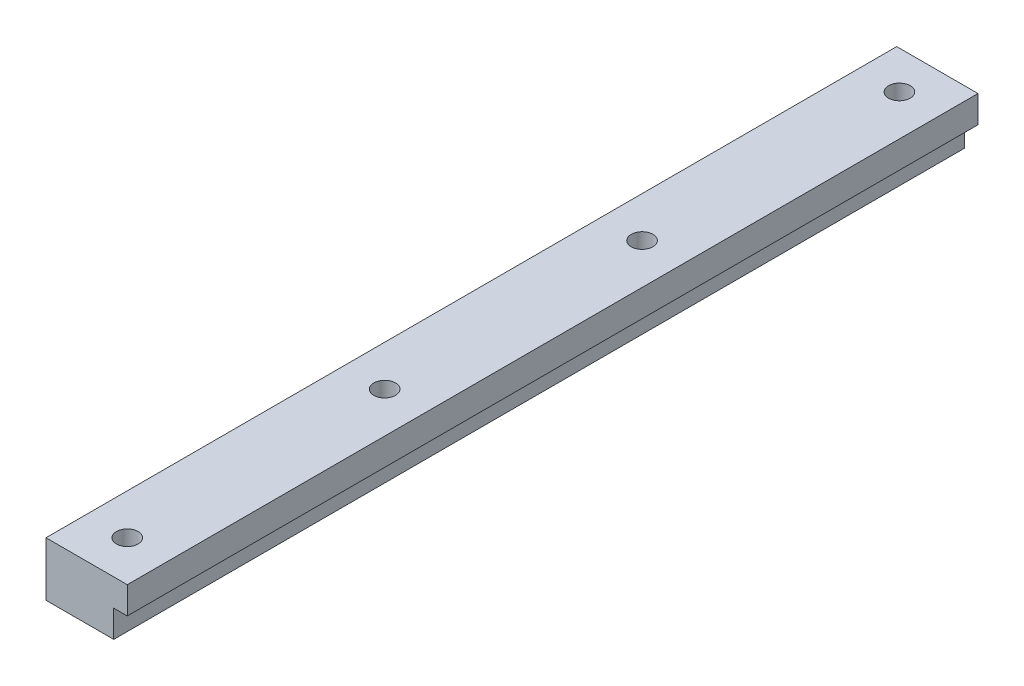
ISO-10303-21;
HEADER;
FILE_DESCRIPTION(('STEP AP214'),'2;1');
FILE_NAME('part.step','',(''),(''),'','','');
FILE_SCHEMA(('AUTOMOTIVE_DESIGN { 1 0 10303 214 1 1 1 1 }'));
ENDSEC;
DATA;
#1=APPLICATION_CONTEXT('core data for automotive mechanical design processes');
#2=APPLICATION_PROTOCOL_DEFINITION('international standard','automotive_design',2000,#1);
#3=PRODUCT_CONTEXT('',#1,'mechanical');
#4=PRODUCT('Part','Part','',(#3));
#5=PRODUCT_RELATED_PRODUCT_CATEGORY('part','',(#4));
#6=PRODUCT_DEFINITION_FORMATION('','',#4);
#7=PRODUCT_DEFINITION_CONTEXT('part definition',#1,'design');
#8=PRODUCT_DEFINITION('design','',#6,#7);
#9=PRODUCT_DEFINITION_SHAPE('','',#8);
#10=(LENGTH_UNIT() NAMED_UNIT(*) SI_UNIT(.MILLI.,.METRE.));
#11=(NAMED_UNIT(*) PLANE_ANGLE_UNIT() SI_UNIT($,.RADIAN.));
#12=(NAMED_UNIT(*) SI_UNIT($,.STERADIAN.) SOLID_ANGLE_UNIT());
#13=UNCERTAINTY_MEASURE_WITH_UNIT(LENGTH_MEASURE(1.E-05),#10,'distance_accuracy_value','');
#14=(GEOMETRIC_REPRESENTATION_CONTEXT(3) GLOBAL_UNCERTAINTY_ASSIGNED_CONTEXT((#13)) GLOBAL_UNIT_ASSIGNED_CONTEXT((#10,
#11,#12)) REPRESENTATION_CONTEXT('',''));
#15=CARTESIAN_POINT('',(0.,0.,0.));
#16=DIRECTION('',(0.,0.,1.));
#17=DIRECTION('',(1.,0.,0.));
#18=AXIS2_PLACEMENT_3D('',#15,#16,#17);
#19=CARTESIAN_POINT('',(25.,0.,314.));
#20=DIRECTION('',(0.,1.,0.));
#21=DIRECTION('',(-1.,0.,0.));
#22=AXIS2_PLACEMENT_3D('',#19,#20,#21);
#23=PLANE('',#22);
#24=CARTESIAN_POINT('',(15.,0.,109.));
#25=DIRECTION('',(0.,1.,0.));
#26=DIRECTION('',(-1.,0.,0.));
#27=AXIS2_PLACEMENT_3D('',#24,#25,#26);
#28=CIRCLE('',#27,4.);
#29=CARTESIAN_POINT('',(11.,0.,109.));
#30=VERTEX_POINT('',#29);
#31=EDGE_CURVE('E151',#30,#30,#28,.T.);
#32=ORIENTED_EDGE('',*,*,#31,.T.);
#33=EDGE_LOOP('',(#32));
#34=FACE_BOUND('',#33,.T.);
#35=CARTESIAN_POINT('',(15.,0.,14.));
#36=DIRECTION('',(0.,1.,0.));
#37=DIRECTION('',(-1.,0.,0.));
#38=AXIS2_PLACEMENT_3D('',#35,#36,#37);
#39=CIRCLE('',#38,4.);
#40=CARTESIAN_POINT('',(11.,0.,14.));
#41=VERTEX_POINT('',#40);
#42=EDGE_CURVE('E155',#41,#41,#39,.T.);
#43=ORIENTED_EDGE('',*,*,#42,.T.);
#44=EDGE_LOOP('',(#43));
#45=FACE_BOUND('',#44,.T.);
#46=CARTESIAN_POINT('',(15.,0.,204.));
#47=DIRECTION('',(0.,1.,0.));
#48=DIRECTION('',(-1.,0.,0.));
#49=AXIS2_PLACEMENT_3D('',#46,#47,#48);
#50=CIRCLE('',#49,4.);
#51=CARTESIAN_POINT('',(11.,0.,204.));
#52=VERTEX_POINT('',#51);
#53=EDGE_CURVE('E159',#52,#52,#50,.T.);
#54=ORIENTED_EDGE('',*,*,#53,.T.);
#55=EDGE_LOOP('',(#54));
#56=FACE_BOUND('',#55,.T.);
#57=CARTESIAN_POINT('',(15.,0.,299.));
#58=DIRECTION('',(0.,1.,0.));
#59=DIRECTION('',(-1.,0.,0.));
#60=AXIS2_PLACEMENT_3D('',#57,#58,#59);
#61=CIRCLE('',#60,4.);
#62=CARTESIAN_POINT('',(11.,0.,299.));
#63=VERTEX_POINT('',#62);
#64=EDGE_CURVE('E87',#63,#63,#61,.T.);
#65=ORIENTED_EDGE('',*,*,#64,.T.);
#66=EDGE_LOOP('',(#65));
#67=FACE_BOUND('',#66,.T.);
#68=DIRECTION('',(1.,0.,0.));
#69=VECTOR('',#68,1.);
#70=CARTESIAN_POINT('',(25.,0.,0.));
#71=LINE('',#70,#69);
#72=CARTESIAN_POINT('',(0.,0.,0.));
#73=VERTEX_POINT('',#72);
#74=CARTESIAN_POINT('',(25.,0.,0.));
#75=VERTEX_POINT('',#74);
#76=EDGE_CURVE('E73',#73,#75,#71,.T.);
#77=ORIENTED_EDGE('',*,*,#76,.T.);
#78=DIRECTION('',(0.,0.,-1.));
#79=VECTOR('',#78,1.);
#80=CARTESIAN_POINT('',(25.,0.,314.));
#81=LINE('',#80,#79);
#82=CARTESIAN_POINT('',(25.,0.,314.));
#83=VERTEX_POINT('',#82);
#84=EDGE_CURVE('E11',#83,#75,#81,.T.);
#85=ORIENTED_EDGE('',*,*,#84,.F.);
#86=DIRECTION('',(1.,0.,0.));
#87=VECTOR('',#86,1.);
#88=CARTESIAN_POINT('',(25.,0.,314.));
#89=LINE('',#88,#87);
#90=CARTESIAN_POINT('',(0.,0.,314.));
#91=VERTEX_POINT('',#90);
#92=EDGE_CURVE('E101',#91,#83,#89,.T.);
#93=ORIENTED_EDGE('',*,*,#92,.F.);
#94=DIRECTION('',(0.,0.,-1.));
#95=VECTOR('',#94,1.);
#96=CARTESIAN_POINT('',(0.,0.,314.));
#97=LINE('',#96,#95);
#98=EDGE_CURVE('E86',#91,#73,#97,.T.);
#99=ORIENTED_EDGE('',*,*,#98,.T.);
#100=EDGE_LOOP('',(#77,#85,#93,#99));
#101=FACE_BOUND('',#100,.T.);
#102=ADVANCED_FACE('F17',(#34,#45,#56,#67,#101),#23,.F.);
#103=CARTESIAN_POINT('',(25.,10.,314.));
#104=DIRECTION('',(-1.,0.,0.));
#105=DIRECTION('',(0.,0.,1.));
#106=AXIS2_PLACEMENT_3D('',#103,#104,#105);
#107=PLANE('',#106);
#108=DIRECTION('',(0.,1.,0.));
#109=VECTOR('',#108,1.);
#110=CARTESIAN_POINT('',(25.,10.,0.));
#111=LINE('',#110,#109);
#112=CARTESIAN_POINT('',(25.,10.,0.));
#113=VERTEX_POINT('',#112);
#114=EDGE_CURVE('E69',#75,#113,#111,.T.);
#115=ORIENTED_EDGE('',*,*,#114,.T.);
#116=DIRECTION('',(0.,0.,-1.));
#117=VECTOR('',#116,1.);
#118=CARTESIAN_POINT('',(25.,10.,314.));
#119=LINE('',#118,#117);
#120=CARTESIAN_POINT('',(25.,10.,314.));
#121=VERTEX_POINT('',#120);
#122=EDGE_CURVE('E24',#121,#113,#119,.T.);
#123=ORIENTED_EDGE('',*,*,#122,.F.);
#124=DIRECTION('',(0.,1.,0.));
#125=VECTOR('',#124,1.);
#126=CARTESIAN_POINT('',(25.,10.,314.));
#127=LINE('',#126,#125);
#128=EDGE_CURVE('E82',#83,#121,#127,.T.);
#129=ORIENTED_EDGE('',*,*,#128,.F.);
#130=ORIENTED_EDGE('',*,*,#84,.T.);
#131=EDGE_LOOP('',(#115,#123,#129,#130));
#132=FACE_BOUND('',#131,.T.);
#133=ADVANCED_FACE('F81',(#132),#107,.F.);
#134=CARTESIAN_POINT('',(30.,10.,314.));
#135=DIRECTION('',(0.,1.,0.));
#136=DIRECTION('',(0.,0.,1.));
#137=AXIS2_PLACEMENT_3D('',#134,#135,#136);
#138=PLANE('',#137);
#139=DIRECTION('',(1.,0.,0.));
#140=VECTOR('',#139,1.);
#141=CARTESIAN_POINT('',(30.,10.,0.));
#142=LINE('',#141,#140);
#143=CARTESIAN_POINT('',(30.,10.,0.));
#144=VERTEX_POINT('',#143);
#145=EDGE_CURVE('E75',#113,#144,#142,.T.);
#146=ORIENTED_EDGE('',*,*,#145,.T.);
#147=DIRECTION('',(0.,0.,-1.));
#148=VECTOR('',#147,1.);
#149=CARTESIAN_POINT('',(30.,10.,314.));
#150=LINE('',#149,#148);
#151=CARTESIAN_POINT('',(30.,10.,314.));
#152=VERTEX_POINT('',#151);
#153=EDGE_CURVE('E117',#152,#144,#150,.T.);
#154=ORIENTED_EDGE('',*,*,#153,.F.);
#155=DIRECTION('',(1.,0.,0.));
#156=VECTOR('',#155,1.);
#157=CARTESIAN_POINT('',(30.,10.,314.));
#158=LINE('',#157,#156);
#159=EDGE_CURVE('E104',#121,#152,#158,.T.);
#160=ORIENTED_EDGE('',*,*,#159,.F.);
#161=ORIENTED_EDGE('',*,*,#122,.T.);
#162=EDGE_LOOP('',(#146,#154,#160,#161));
#163=FACE_BOUND('',#162,.T.);
#164=ADVANCED_FACE('F121',(#163),#138,.F.);
#165=CARTESIAN_POINT('',(30.,20.,314.));
#166=DIRECTION('',(-1.,0.,0.));
#167=DIRECTION('',(0.,-1.,0.));
#168=AXIS2_PLACEMENT_3D('',#165,#166,#167);
#169=PLANE('',#168);
#170=DIRECTION('',(0.,1.,0.));
#171=VECTOR('',#170,1.);
#172=CARTESIAN_POINT('',(30.,20.,0.));
#173=LINE('',#172,#171);
#174=CARTESIAN_POINT('',(30.,20.,0.));
#175=VERTEX_POINT('',#174);
#176=EDGE_CURVE('E95',#144,#175,#173,.T.);
#177=ORIENTED_EDGE('',*,*,#176,.T.);
#178=DIRECTION('',(0.,0.,-1.));
#179=VECTOR('',#178,1.);
#180=CARTESIAN_POINT('',(30.,20.,314.));
#181=LINE('',#180,#179);
#182=CARTESIAN_POINT('',(30.,20.,314.));
#183=VERTEX_POINT('',#182);
#184=EDGE_CURVE('E114',#183,#175,#181,.T.);
#185=ORIENTED_EDGE('',*,*,#184,.F.);
#186=DIRECTION('',(0.,1.,0.));
#187=VECTOR('',#186,1.);
#188=CARTESIAN_POINT('',(30.,20.,314.));
#189=LINE('',#188,#187);
#190=EDGE_CURVE('E106',#152,#183,#189,.T.);
#191=ORIENTED_EDGE('',*,*,#190,.F.);
#192=ORIENTED_EDGE('',*,*,#153,.T.);
#193=EDGE_LOOP('',(#177,#185,#191,#192));
#194=FACE_BOUND('',#193,.T.);
#195=ADVANCED_FACE('F127',(#194),#169,.F.);
#196=CARTESIAN_POINT('',(0.,20.,314.));
#197=DIRECTION('',(0.,-1.,0.));
#198=DIRECTION('',(0.,0.,-1.));
#199=AXIS2_PLACEMENT_3D('',#196,#197,#198);
#200=PLANE('',#199);
#201=CARTESIAN_POINT('',(15.,20.,109.));
#202=DIRECTION('',(0.,1.,0.));
#203=DIRECTION('',(0.,0.,1.));
#204=AXIS2_PLACEMENT_3D('',#201,#202,#203);
#205=CIRCLE('',#204,4.);
#206=CARTESIAN_POINT('',(15.,20.,113.));
#207=VERTEX_POINT('',#206);
#208=EDGE_CURVE('E189',#207,#207,#205,.T.);
#209=ORIENTED_EDGE('',*,*,#208,.F.);
#210=EDGE_LOOP('',(#209));
#211=FACE_BOUND('',#210,.T.);
#212=CARTESIAN_POINT('',(15.,20.,14.));
#213=DIRECTION('',(0.,1.,0.));
#214=DIRECTION('',(0.,0.,1.));
#215=AXIS2_PLACEMENT_3D('',#212,#213,#214);
#216=CIRCLE('',#215,4.);
#217=CARTESIAN_POINT('',(15.,20.,18.));
#218=VERTEX_POINT('',#217);
#219=EDGE_CURVE('E190',#218,#218,#216,.T.);
#220=ORIENTED_EDGE('',*,*,#219,.F.);
#221=EDGE_LOOP('',(#220));
#222=FACE_BOUND('',#221,.T.);
#223=CARTESIAN_POINT('',(15.,20.,204.));
#224=DIRECTION('',(0.,1.,0.));
#225=DIRECTION('',(0.,0.,1.));
#226=AXIS2_PLACEMENT_3D('',#223,#224,#225);
#227=CIRCLE('',#226,4.);
#228=CARTESIAN_POINT('',(15.,20.,208.));
#229=VERTEX_POINT('',#228);
#230=EDGE_CURVE('E197',#229,#229,#227,.T.);
#231=ORIENTED_EDGE('',*,*,#230,.F.);
#232=EDGE_LOOP('',(#231));
#233=FACE_BOUND('',#232,.T.);
#234=CARTESIAN_POINT('',(15.,20.,299.));
#235=DIRECTION('',(0.,1.,0.));
#236=DIRECTION('',(0.,0.,1.));
#237=AXIS2_PLACEMENT_3D('',#234,#235,#236);
#238=CIRCLE('',#237,4.);
#239=CARTESIAN_POINT('',(15.,20.,303.));
#240=VERTEX_POINT('',#239);
#241=EDGE_CURVE('E90',#240,#240,#238,.T.);
#242=ORIENTED_EDGE('',*,*,#241,.F.);
#243=EDGE_LOOP('',(#242));
#244=FACE_BOUND('',#243,.T.);
#245=DIRECTION('',(-1.,0.,0.));
#246=VECTOR('',#245,1.);
#247=CARTESIAN_POINT('',(0.,20.,0.));
#248=LINE('',#247,#246);
#249=CARTESIAN_POINT('',(0.,20.,0.));
#250=VERTEX_POINT('',#249);
#251=EDGE_CURVE('E97',#175,#250,#248,.T.);
#252=ORIENTED_EDGE('',*,*,#251,.T.);
#253=DIRECTION('',(0.,0.,-1.));
#254=VECTOR('',#253,1.);
#255=CARTESIAN_POINT('',(0.,20.,314.));
#256=LINE('',#255,#254);
#257=CARTESIAN_POINT('',(0.,20.,314.));
#258=VERTEX_POINT('',#257);
#259=EDGE_CURVE('E111',#258,#250,#256,.T.);
#260=ORIENTED_EDGE('',*,*,#259,.F.);
#261=DIRECTION('',(-1.,0.,0.));
#262=VECTOR('',#261,1.);
#263=CARTESIAN_POINT('',(0.,20.,314.));
#264=LINE('',#263,#262);
#265=EDGE_CURVE('E36',#183,#258,#264,.T.);
#266=ORIENTED_EDGE('',*,*,#265,.F.);
#267=ORIENTED_EDGE('',*,*,#184,.T.);
#268=EDGE_LOOP('',(#252,#260,#266,#267));
#269=FACE_BOUND('',#268,.T.);
#270=ADVANCED_FACE('F130',(#211,#222,#233,#244,#269),#200,.F.);
#271=CARTESIAN_POINT('',(0.,0.,314.));
#272=DIRECTION('',(1.,0.,0.));
#273=DIRECTION('',(0.,0.,-1.));
#274=AXIS2_PLACEMENT_3D('',#271,#272,#273);
#275=PLANE('',#274);
#276=DIRECTION('',(0.,-1.,0.));
#277=VECTOR('',#276,1.);
#278=CARTESIAN_POINT('',(0.,0.,0.));
#279=LINE('',#278,#277);
#280=EDGE_CURVE('E99',#250,#73,#279,.T.);
#281=ORIENTED_EDGE('',*,*,#280,.T.);
#282=ORIENTED_EDGE('',*,*,#98,.F.);
#283=DIRECTION('',(0.,-1.,0.));
#284=VECTOR('',#283,1.);
#285=CARTESIAN_POINT('',(0.,0.,314.));
#286=LINE('',#285,#284);
#287=EDGE_CURVE('E31',#258,#91,#286,.T.);
#288=ORIENTED_EDGE('',*,*,#287,.F.);
#289=ORIENTED_EDGE('',*,*,#259,.T.);
#290=EDGE_LOOP('',(#281,#282,#288,#289));
#291=FACE_BOUND('',#290,.T.);
#292=ADVANCED_FACE('F132',(#291),#275,.F.);
#293=CARTESIAN_POINT('',(0.,0.,314.));
#294=DIRECTION('',(0.,0.,-1.));
#295=DIRECTION('',(-1.,0.,0.));
#296=AXIS2_PLACEMENT_3D('',#293,#294,#295);
#297=PLANE('',#296);
#298=ORIENTED_EDGE('',*,*,#92,.T.);
#299=ORIENTED_EDGE('',*,*,#128,.T.);
#300=ORIENTED_EDGE('',*,*,#159,.T.);
#301=ORIENTED_EDGE('',*,*,#190,.T.);
#302=ORIENTED_EDGE('',*,*,#265,.T.);
#303=ORIENTED_EDGE('',*,*,#287,.T.);
#304=EDGE_LOOP('',(#298,#299,#300,#301,#302,#303));
#305=FACE_BOUND('',#304,.T.);
#306=ADVANCED_FACE('F124',(#305),#297,.F.);
#307=CARTESIAN_POINT('',(0.,0.,0.));
#308=DIRECTION('',(0.,0.,-1.));
#309=DIRECTION('',(-1.,0.,0.));
#310=AXIS2_PLACEMENT_3D('',#307,#308,#309);
#311=PLANE('',#310);
#312=ORIENTED_EDGE('',*,*,#76,.F.);
#313=ORIENTED_EDGE('',*,*,#280,.F.);
#314=ORIENTED_EDGE('',*,*,#251,.F.);
#315=ORIENTED_EDGE('',*,*,#176,.F.);
#316=ORIENTED_EDGE('',*,*,#145,.F.);
#317=ORIENTED_EDGE('',*,*,#114,.F.);
#318=EDGE_LOOP('',(#312,#313,#314,#315,#316,#317));
#319=FACE_BOUND('',#318,.T.);
#320=ADVANCED_FACE('F70',(#319),#311,.T.);
#321=CARTESIAN_POINT('',(15.,20.,299.));
#322=DIRECTION('',(0.,1.,0.));
#323=DIRECTION('',(0.,0.,1.));
#324=AXIS2_PLACEMENT_3D('',#321,#322,#323);
#325=CYLINDRICAL_SURFACE('',#324,4.);
#326=ORIENTED_EDGE('',*,*,#241,.T.);
#327=EDGE_LOOP('',(#326));
#328=FACE_BOUND('',#327,.T.);
#329=ORIENTED_EDGE('',*,*,#64,.F.);
#330=EDGE_LOOP('',(#329));
#331=FACE_BOUND('',#330,.T.);
#332=ADVANCED_FACE('F162',(#328,#331),#325,.F.);
#333=CARTESIAN_POINT('',(15.,20.,204.));
#334=DIRECTION('',(0.,1.,0.));
#335=DIRECTION('',(0.,0.,1.));
#336=AXIS2_PLACEMENT_3D('',#333,#334,#335);
#337=CYLINDRICAL_SURFACE('',#336,4.);
#338=ORIENTED_EDGE('',*,*,#230,.T.);
#339=EDGE_LOOP('',(#338));
#340=FACE_BOUND('',#339,.T.);
#341=ORIENTED_EDGE('',*,*,#53,.F.);
#342=EDGE_LOOP('',(#341));
#343=FACE_BOUND('',#342,.T.);
#344=ADVANCED_FACE('F164',(#340,#343),#337,.F.);
#345=CARTESIAN_POINT('',(15.,20.,14.));
#346=DIRECTION('',(0.,1.,0.));
#347=DIRECTION('',(0.,0.,1.));
#348=AXIS2_PLACEMENT_3D('',#345,#346,#347);
#349=CYLINDRICAL_SURFACE('',#348,4.);
#350=ORIENTED_EDGE('',*,*,#219,.T.);
#351=EDGE_LOOP('',(#350));
#352=FACE_BOUND('',#351,.T.);
#353=ORIENTED_EDGE('',*,*,#42,.F.);
#354=EDGE_LOOP('',(#353));
#355=FACE_BOUND('',#354,.T.);
#356=ADVANCED_FACE('F170',(#352,#355),#349,.F.);
#357=CARTESIAN_POINT('',(15.,20.,109.));
#358=DIRECTION('',(0.,1.,0.));
#359=DIRECTION('',(0.,0.,1.));
#360=AXIS2_PLACEMENT_3D('',#357,#358,#359);
#361=CYLINDRICAL_SURFACE('',#360,4.);
#362=ORIENTED_EDGE('',*,*,#208,.T.);
#363=EDGE_LOOP('',(#362));
#364=FACE_BOUND('',#363,.T.);
#365=ORIENTED_EDGE('',*,*,#31,.F.);
#366=EDGE_LOOP('',(#365));
#367=FACE_BOUND('',#366,.T.);
#368=ADVANCED_FACE('F179',(#364,#367),#361,.F.);
#369=CLOSED_SHELL('',(#102,#133,#164,#195,#270,#292,#306,#320,#332,#344,#356,#368));
#370=MANIFOLD_SOLID_BREP('B1',#369);
#371=ADVANCED_BREP_SHAPE_REPRESENTATION('',(#18,#370),#14);
#372=SHAPE_DEFINITION_REPRESENTATION(#9,#371);
ENDSEC;
END-ISO-10303-21;
